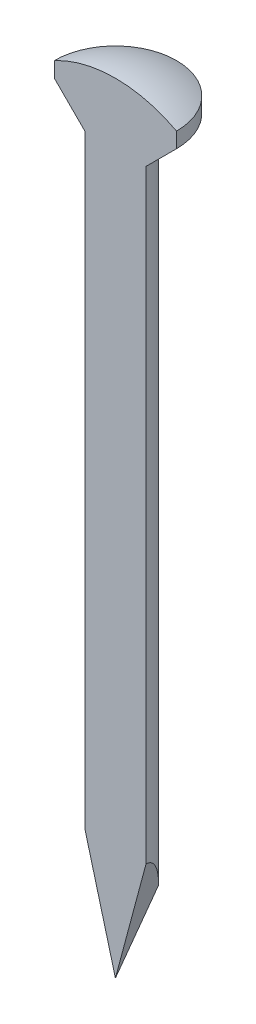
ISO-10303-21;
HEADER;
FILE_DESCRIPTION(('STEP AP214'),'2;1');
FILE_NAME('part.step','',(''),(''),'','','');
FILE_SCHEMA(('AUTOMOTIVE_DESIGN { 1 0 10303 214 1 1 1 1 }'));
ENDSEC;
DATA;
#1=APPLICATION_CONTEXT('core data for automotive mechanical design processes');
#2=APPLICATION_PROTOCOL_DEFINITION('international standard','automotive_design',2000,#1);
#3=PRODUCT_CONTEXT('',#1,'mechanical');
#4=PRODUCT('Part','Part','',(#3));
#5=PRODUCT_RELATED_PRODUCT_CATEGORY('part','',(#4));
#6=PRODUCT_DEFINITION_FORMATION('','',#4);
#7=PRODUCT_DEFINITION_CONTEXT('part definition',#1,'design');
#8=PRODUCT_DEFINITION('design','',#6,#7);
#9=PRODUCT_DEFINITION_SHAPE('','',#8);
#10=(LENGTH_UNIT() NAMED_UNIT(*) SI_UNIT(.MILLI.,.METRE.));
#11=(NAMED_UNIT(*) PLANE_ANGLE_UNIT() SI_UNIT($,.RADIAN.));
#12=(NAMED_UNIT(*) SI_UNIT($,.STERADIAN.) SOLID_ANGLE_UNIT());
#13=UNCERTAINTY_MEASURE_WITH_UNIT(LENGTH_MEASURE(1.E-05),#10,'distance_accuracy_value','');
#14=(GEOMETRIC_REPRESENTATION_CONTEXT(3) GLOBAL_UNCERTAINTY_ASSIGNED_CONTEXT((#13)) GLOBAL_UNIT_ASSIGNED_CONTEXT((#10,
#11,#12)) REPRESENTATION_CONTEXT('',''));
#15=CARTESIAN_POINT('',(0.,0.,0.));
#16=DIRECTION('',(0.,0.,1.));
#17=DIRECTION('',(1.,0.,0.));
#18=AXIS2_PLACEMENT_3D('',#15,#16,#17);
#19=CARTESIAN_POINT('',(0.,0.,0.));
#20=DIRECTION('',(0.,1.,0.));
#21=DIRECTION('',(-1.,0.,0.));
#22=AXIS2_PLACEMENT_3D('',#19,#20,#21);
#23=PLANE('',#22);
#24=DIRECTION('',(-1.,0.,0.));
#25=VECTOR('',#24,1.);
#26=CARTESIAN_POINT('',(-2.63285024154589,0.,0.));
#27=LINE('',#26,#25);
#28=CARTESIAN_POINT('',(0.000999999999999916,0.,0.));
#29=VERTEX_POINT('',#28);
#30=CARTESIAN_POINT('',(-0.00100000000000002,0.,0.));
#31=VERTEX_POINT('',#30);
#32=EDGE_CURVE('E84',#29,#31,#27,.T.);
#33=ORIENTED_EDGE('',*,*,#32,.T.);
#34=DIRECTION('',(0.,0.,-1.));
#35=VECTOR('',#34,1.);
#36=CARTESIAN_POINT('',(-0.00100000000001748,0.,2.5));
#37=LINE('',#36,#35);
#38=CARTESIAN_POINT('',(-0.000999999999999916,0.,-0.00100000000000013));
#39=VERTEX_POINT('',#38);
#40=EDGE_CURVE('E93',#31,#39,#37,.T.);
#41=ORIENTED_EDGE('',*,*,#40,.T.);
#42=DIRECTION('',(1.,0.,0.));
#43=VECTOR('',#42,1.);
#44=CARTESIAN_POINT('',(-2.5,0.,-0.00100000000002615));
#45=LINE('',#44,#43);
#46=CARTESIAN_POINT('',(0.000999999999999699,0.,-0.00100000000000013));
#47=VERTEX_POINT('',#46);
#48=EDGE_CURVE('E106',#39,#47,#45,.T.);
#49=ORIENTED_EDGE('',*,*,#48,.T.);
#50=DIRECTION('',(0.,0.,1.));
#51=VECTOR('',#50,1.);
#52=CARTESIAN_POINT('',(0.000999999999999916,0.,-2.5));
#53=LINE('',#52,#51);
#54=EDGE_CURVE('E96',#47,#29,#53,.T.);
#55=ORIENTED_EDGE('',*,*,#54,.T.);
#56=EDGE_LOOP('',(#33,#41,#49,#55));
#57=FACE_BOUND('',#56,.T.);
#58=ADVANCED_FACE('F24',(#57),#23,.F.);
#59=CARTESIAN_POINT('',(0.,31.5099229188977,0.));
#60=DIRECTION('',(0.,1.,0.));
#61=DIRECTION('',(-1.,0.,0.));
#62=AXIS2_PLACEMENT_3D('',#59,#60,#61);
#63=CYLINDRICAL_SURFACE('',#62,1.);
#64=DIRECTION('',(0.,1.,0.));
#65=VECTOR('',#64,1.);
#66=CARTESIAN_POINT('',(1.,31.5099229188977,0.));
#67=LINE('',#66,#65);
#68=CARTESIAN_POINT('',(1.,23.5,0.));
#69=VERTEX_POINT('',#68);
#70=CARTESIAN_POINT('',(1.,3.72831875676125,0.));
#71=VERTEX_POINT('',#70);
#72=EDGE_CURVE('E137',#69,#71,#67,.F.);
#73=ORIENTED_EDGE('',*,*,#72,.T.);
#74=CARTESIAN_POINT('',(0.,-0.00373205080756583,0.));
#75=DIRECTION('',(-0.965925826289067,0.258819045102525,0.));
#76=DIRECTION('',(0.258819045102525,0.965925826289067,0.));
#77=AXIS2_PLACEMENT_3D('',#74,#75,#76);
#78=ELLIPSE('',#77,3.86370330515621,1.);
#79=CARTESIAN_POINT('',(0.707106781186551,2.63522638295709,-0.707106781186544));
#80=VERTEX_POINT('',#79);
#81=EDGE_CURVE('E47',#71,#80,#78,.T.);
#82=ORIENTED_EDGE('',*,*,#81,.T.);
#83=CARTESIAN_POINT('',(0.,-0.00373205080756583,0.));
#84=DIRECTION('',(0.,0.258819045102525,0.965925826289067));
#85=DIRECTION('',(0.,0.965925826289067,-0.258819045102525));
#86=AXIS2_PLACEMENT_3D('',#83,#84,#85);
#87=ELLIPSE('',#86,3.86370330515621,1.);
#88=CARTESIAN_POINT('',(-0.707106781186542,2.63522638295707,-0.707106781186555));
#89=VERTEX_POINT('',#88);
#90=EDGE_CURVE('E103',#80,#89,#87,.T.);
#91=ORIENTED_EDGE('',*,*,#90,.T.);
#92=CARTESIAN_POINT('',(0.,-0.00373205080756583,0.));
#93=DIRECTION('',(0.965925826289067,0.258819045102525,0.));
#94=DIRECTION('',(-0.258819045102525,0.965925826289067,0.));
#95=AXIS2_PLACEMENT_3D('',#92,#93,#94);
#96=ELLIPSE('',#95,3.86370330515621,1.);
#97=CARTESIAN_POINT('',(-1.,3.72831875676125,0.));
#98=VERTEX_POINT('',#97);
#99=EDGE_CURVE('E11',#89,#98,#96,.T.);
#100=ORIENTED_EDGE('',*,*,#99,.T.);
#101=DIRECTION('',(0.,1.,0.));
#102=VECTOR('',#101,1.);
#103=CARTESIAN_POINT('',(-1.,31.5099229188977,0.));
#104=LINE('',#103,#102);
#105=CARTESIAN_POINT('',(-1.,23.5,0.));
#106=VERTEX_POINT('',#105);
#107=EDGE_CURVE('E39',#98,#106,#104,.T.);
#108=ORIENTED_EDGE('',*,*,#107,.T.);
#109=CARTESIAN_POINT('',(0.,23.5,0.));
#110=DIRECTION('',(0.,1.,0.));
#111=DIRECTION('',(-1.,0.,0.));
#112=AXIS2_PLACEMENT_3D('',#109,#110,#111);
#113=CIRCLE('',#112,1.);
#114=EDGE_CURVE('E117',#69,#106,#113,.T.);
#115=ORIENTED_EDGE('',*,*,#114,.F.);
#116=EDGE_LOOP('',(#73,#82,#91,#100,#108,#115));
#117=FACE_BOUND('',#116,.T.);
#118=ADVANCED_FACE('F144',(#117),#63,.T.);
#119=CARTESIAN_POINT('',(0.,23.5,0.));
#120=DIRECTION('',(0.,1.,0.));
#121=DIRECTION('',(-1.,0.,0.));
#122=AXIS2_PLACEMENT_3D('',#119,#120,#121);
#123=CONICAL_SURFACE('',#122,1.,0.785398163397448);
#124=DIRECTION('',(0.707106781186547,0.707106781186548,0.));
#125=VECTOR('',#124,1.);
#126=CARTESIAN_POINT('',(0.,22.5,0.));
#127=LINE('',#126,#125);
#128=CARTESIAN_POINT('',(2.,24.5,0.));
#129=VERTEX_POINT('',#128);
#130=EDGE_CURVE('E131',#129,#69,#127,.F.);
#131=ORIENTED_EDGE('',*,*,#130,.T.);
#132=ORIENTED_EDGE('',*,*,#114,.T.);
#133=DIRECTION('',(0.707106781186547,-0.707106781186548,0.));
#134=VECTOR('',#133,1.);
#135=CARTESIAN_POINT('',(0.,22.5,0.));
#136=LINE('',#135,#134);
#137=CARTESIAN_POINT('',(-2.,24.5,0.));
#138=VERTEX_POINT('',#137);
#139=EDGE_CURVE('E139',#106,#138,#136,.F.);
#140=ORIENTED_EDGE('',*,*,#139,.T.);
#141=CARTESIAN_POINT('',(0.,24.5,0.));
#142=DIRECTION('',(0.,1.,0.));
#143=DIRECTION('',(-1.,0.,0.));
#144=AXIS2_PLACEMENT_3D('',#141,#142,#143);
#145=CIRCLE('',#144,2.);
#146=EDGE_CURVE('E114',#129,#138,#145,.T.);
#147=ORIENTED_EDGE('',*,*,#146,.F.);
#148=EDGE_LOOP('',(#131,#132,#140,#147));
#149=FACE_BOUND('',#148,.T.);
#150=ADVANCED_FACE('F146',(#149),#123,.T.);
#151=CARTESIAN_POINT('',(0.,31.5099229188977,0.));
#152=DIRECTION('',(0.,1.,0.));
#153=DIRECTION('',(-1.,0.,0.));
#154=AXIS2_PLACEMENT_3D('',#151,#152,#153);
#155=CYLINDRICAL_SURFACE('',#154,2.);
#156=DIRECTION('',(0.,1.,0.));
#157=VECTOR('',#156,1.);
#158=CARTESIAN_POINT('',(2.,31.5099229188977,0.));
#159=LINE('',#158,#157);
#160=CARTESIAN_POINT('',(2.,25.,0.));
#161=VERTEX_POINT('',#160);
#162=EDGE_CURVE('E125',#161,#129,#159,.F.);
#163=ORIENTED_EDGE('',*,*,#162,.T.);
#164=ORIENTED_EDGE('',*,*,#146,.T.);
#165=DIRECTION('',(0.,1.,0.));
#166=VECTOR('',#165,1.);
#167=CARTESIAN_POINT('',(-2.,31.5099229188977,0.));
#168=LINE('',#167,#166);
#169=CARTESIAN_POINT('',(-2.,25.,0.));
#170=VERTEX_POINT('',#169);
#171=EDGE_CURVE('E134',#138,#170,#168,.T.);
#172=ORIENTED_EDGE('',*,*,#171,.T.);
#173=CARTESIAN_POINT('',(0.,25.,0.));
#174=DIRECTION('',(0.,1.,0.));
#175=DIRECTION('',(-1.,0.,0.));
#176=AXIS2_PLACEMENT_3D('',#173,#174,#175);
#177=CIRCLE('',#176,2.);
#178=EDGE_CURVE('E111',#161,#170,#177,.T.);
#179=ORIENTED_EDGE('',*,*,#178,.F.);
#180=EDGE_LOOP('',(#163,#164,#172,#179));
#181=FACE_BOUND('',#180,.T.);
#182=ADVANCED_FACE('F151',(#181),#155,.T.);
#183=CARTESIAN_POINT('',(0.,21.25,0.));
#184=DIRECTION('',(0.,0.,1.));
#185=DIRECTION('',(1.,0.,0.));
#186=AXIS2_PLACEMENT_3D('',#183,#184,#185);
#187=SPHERICAL_SURFACE('',#186,4.25);
#188=ORIENTED_EDGE('',*,*,#178,.T.);
#189=CARTESIAN_POINT('',(0.,21.25,0.));
#190=DIRECTION('',(0.,0.,1.));
#191=DIRECTION('',(1.,0.,0.));
#192=AXIS2_PLACEMENT_3D('',#189,#190,#191);
#193=CIRCLE('',#192,4.25);
#194=EDGE_CURVE('E127',#161,#170,#193,.T.);
#195=ORIENTED_EDGE('',*,*,#194,.F.);
#196=EDGE_LOOP('',(#188,#195));
#197=FACE_BOUND('',#196,.T.);
#198=ADVANCED_FACE('F26',(#197),#187,.T.);
#199=CARTESIAN_POINT('',(1.,3.72831875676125,-2.5));
#200=DIRECTION('',(-0.965925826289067,0.258819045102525,0.));
#201=DIRECTION('',(-0.258819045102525,-0.965925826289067,0.));
#202=AXIS2_PLACEMENT_3D('',#199,#200,#201);
#203=PLANE('',#202);
#204=DIRECTION('',(-0.258819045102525,-0.965925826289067,0.));
#205=VECTOR('',#204,1.);
#206=CARTESIAN_POINT('',(-0.272958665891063,-1.02242766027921,0.));
#207=LINE('',#206,#205);
#208=EDGE_CURVE('E97',#71,#29,#207,.T.);
#209=ORIENTED_EDGE('',*,*,#208,.T.);
#210=ORIENTED_EDGE('',*,*,#54,.F.);
#211=DIRECTION('',(0.250562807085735,0.935113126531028,-0.250562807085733));
#212=VECTOR('',#211,1.);
#213=CARTESIAN_POINT('',(1.09417258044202,4.07977561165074,-1.09417258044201));
#214=LINE('',#213,#212);
#215=EDGE_CURVE('E32',#47,#80,#214,.T.);
#216=ORIENTED_EDGE('',*,*,#215,.T.);
#217=ORIENTED_EDGE('',*,*,#81,.F.);
#218=EDGE_LOOP('',(#209,#210,#216,#217));
#219=FACE_BOUND('',#218,.T.);
#220=ADVANCED_FACE('F122',(#219),#203,.F.);
#221=CARTESIAN_POINT('',(-1.00000000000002,3.72831875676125,2.49999999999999));
#222=DIRECTION('',(0.965925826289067,0.258819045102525,0.));
#223=DIRECTION('',(-0.258819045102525,0.965925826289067,0.));
#224=AXIS2_PLACEMENT_3D('',#221,#222,#223);
#225=PLANE('',#224);
#226=DIRECTION('',(-0.258819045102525,0.965925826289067,0.));
#227=VECTOR('',#226,1.);
#228=CARTESIAN_POINT('',(-0.0797763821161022,0.293997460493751,0.));
#229=LINE('',#228,#227);
#230=EDGE_CURVE('E81',#31,#98,#229,.T.);
#231=ORIENTED_EDGE('',*,*,#230,.T.);
#232=ORIENTED_EDGE('',*,*,#99,.F.);
#233=DIRECTION('',(0.250562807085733,-0.935113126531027,0.250562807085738));
#234=VECTOR('',#233,1.);
#235=CARTESIAN_POINT('',(-0.780263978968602,2.90825276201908,-0.780263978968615));
#236=LINE('',#235,#234);
#237=EDGE_CURVE('E101',#89,#39,#236,.T.);
#238=ORIENTED_EDGE('',*,*,#237,.T.);
#239=ORIENTED_EDGE('',*,*,#40,.F.);
#240=EDGE_LOOP('',(#231,#232,#238,#239));
#241=FACE_BOUND('',#240,.T.);
#242=ADVANCED_FACE('F99',(#241),#225,.F.);
#243=CARTESIAN_POINT('',(-2.49999999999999,3.72831875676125,-1.00000000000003));
#244=DIRECTION('',(0.,0.258819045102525,0.965925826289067));
#245=DIRECTION('',(0.,-0.965925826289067,0.258819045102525));
#246=AXIS2_PLACEMENT_3D('',#243,#244,#245);
#247=PLANE('',#246);
#248=ORIENTED_EDGE('',*,*,#90,.F.);
#249=ORIENTED_EDGE('',*,*,#215,.F.);
#250=ORIENTED_EDGE('',*,*,#48,.F.);
#251=ORIENTED_EDGE('',*,*,#237,.F.);
#252=EDGE_LOOP('',(#248,#249,#250,#251));
#253=FACE_BOUND('',#252,.T.);
#254=ADVANCED_FACE('F124',(#253),#247,.F.);
#255=CARTESIAN_POINT('',(-2.63285024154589,-0.390096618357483,0.));
#256=DIRECTION('',(0.,0.,1.));
#257=DIRECTION('',(1.,0.,0.));
#258=AXIS2_PLACEMENT_3D('',#255,#256,#257);
#259=PLANE('',#258);
#260=ORIENTED_EDGE('',*,*,#194,.T.);
#261=ORIENTED_EDGE('',*,*,#171,.F.);
#262=ORIENTED_EDGE('',*,*,#139,.F.);
#263=ORIENTED_EDGE('',*,*,#107,.F.);
#264=ORIENTED_EDGE('',*,*,#230,.F.);
#265=ORIENTED_EDGE('',*,*,#32,.F.);
#266=ORIENTED_EDGE('',*,*,#208,.F.);
#267=ORIENTED_EDGE('',*,*,#72,.F.);
#268=ORIENTED_EDGE('',*,*,#130,.F.);
#269=ORIENTED_EDGE('',*,*,#162,.F.);
#270=EDGE_LOOP('',(#260,#261,#262,#263,#264,#265,#266,#267,#268,#269));
#271=FACE_BOUND('',#270,.T.);
#272=ADVANCED_FACE('F83',(#271),#259,.T.);
#273=CLOSED_SHELL('',(#58,#118,#150,#182,#198,#220,#242,#254,#272));
#274=MANIFOLD_SOLID_BREP('B2',#273);
#275=ADVANCED_BREP_SHAPE_REPRESENTATION('',(#18,#274),#14);
#276=SHAPE_DEFINITION_REPRESENTATION(#9,#275);
ENDSEC;
END-ISO-10303-21;
